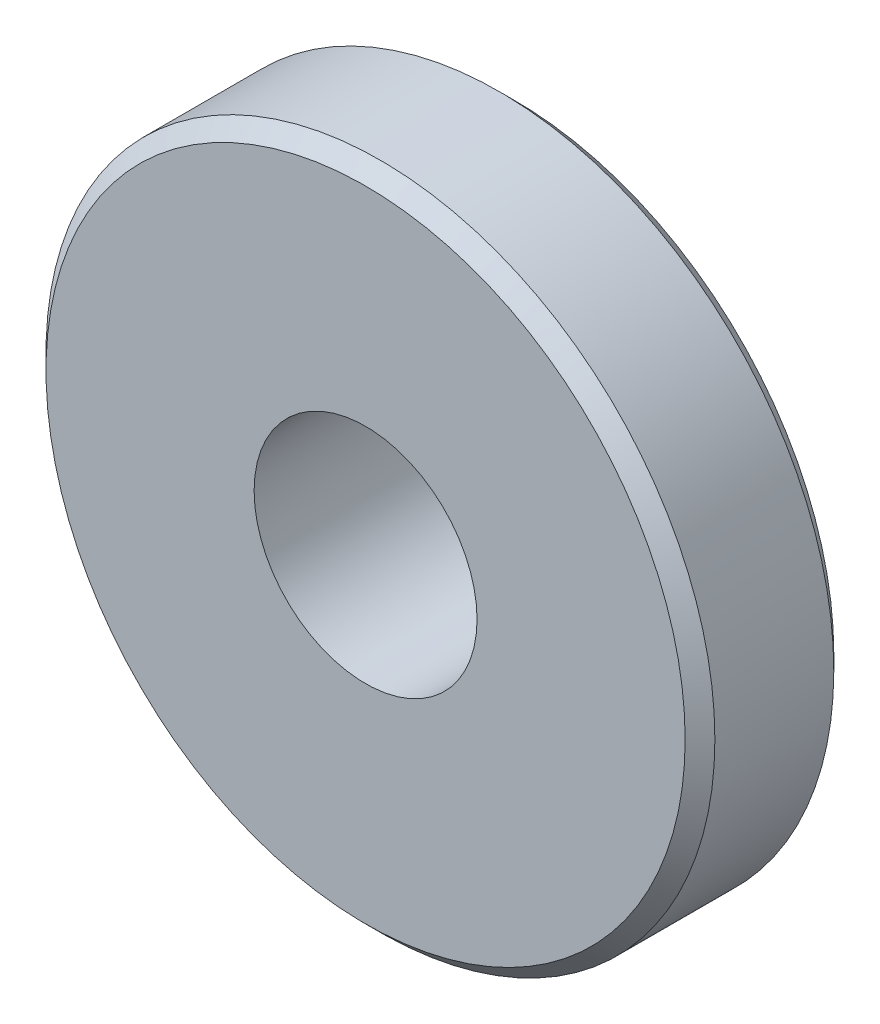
ISO-10303-21;
HEADER;
FILE_DESCRIPTION(('STEP AP214'),'2;1');
FILE_NAME('part.step','',(''),(''),'','','');
FILE_SCHEMA(('AUTOMOTIVE_DESIGN { 1 0 10303 214 1 1 1 1 }'));
ENDSEC;
DATA;
#1=APPLICATION_CONTEXT('core data for automotive mechanical design processes');
#2=APPLICATION_PROTOCOL_DEFINITION('international standard','automotive_design',2000,#1);
#3=PRODUCT_CONTEXT('',#1,'mechanical');
#4=PRODUCT('Part','Part','',(#3));
#5=PRODUCT_RELATED_PRODUCT_CATEGORY('part','',(#4));
#6=PRODUCT_DEFINITION_FORMATION('','',#4);
#7=PRODUCT_DEFINITION_CONTEXT('part definition',#1,'design');
#8=PRODUCT_DEFINITION('design','',#6,#7);
#9=PRODUCT_DEFINITION_SHAPE('','',#8);
#10=(LENGTH_UNIT() NAMED_UNIT(*) SI_UNIT(.MILLI.,.METRE.));
#11=(NAMED_UNIT(*) PLANE_ANGLE_UNIT() SI_UNIT($,.RADIAN.));
#12=(NAMED_UNIT(*) SI_UNIT($,.STERADIAN.) SOLID_ANGLE_UNIT());
#13=UNCERTAINTY_MEASURE_WITH_UNIT(LENGTH_MEASURE(1.E-05),#10,'distance_accuracy_value','');
#14=(GEOMETRIC_REPRESENTATION_CONTEXT(3) GLOBAL_UNCERTAINTY_ASSIGNED_CONTEXT((#13)) GLOBAL_UNIT_ASSIGNED_CONTEXT((#10,
#11,#12)) REPRESENTATION_CONTEXT('',''));
#15=CARTESIAN_POINT('',(0.,0.,0.));
#16=DIRECTION('',(0.,0.,1.));
#17=DIRECTION('',(1.,0.,0.));
#18=AXIS2_PLACEMENT_3D('',#15,#16,#17);
#19=CARTESIAN_POINT('',(0.,0.,2.));
#20=DIRECTION('',(0.,0.,-1.));
#21=DIRECTION('',(-1.,0.,0.));
#22=AXIS2_PLACEMENT_3D('',#19,#20,#21);
#23=CYLINDRICAL_SURFACE('',#22,10.);
#24=CARTESIAN_POINT('',(0.,0.,1.51));
#25=DIRECTION('',(0.,0.,1.));
#26=DIRECTION('',(1.,0.,0.));
#27=AXIS2_PLACEMENT_3D('',#24,#25,#26);
#28=CIRCLE('',#27,10.);
#29=CARTESIAN_POINT('',(10.,0.,1.51));
#30=VERTEX_POINT('',#29);
#31=EDGE_CURVE('E8',#30,#30,#28,.F.);
#32=ORIENTED_EDGE('',*,*,#31,.T.);
#33=EDGE_LOOP('',(#32));
#34=FACE_BOUND('',#33,.T.);
#35=CARTESIAN_POINT('',(0.,0.,0.));
#36=DIRECTION('',(0.,0.,1.));
#37=DIRECTION('',(1.,0.,0.));
#38=AXIS2_PLACEMENT_3D('',#35,#36,#37);
#39=CIRCLE('',#38,10.);
#40=CARTESIAN_POINT('',(10.,0.,0.));
#41=VERTEX_POINT('',#40);
#42=EDGE_CURVE('E38',#41,#41,#39,.T.);
#43=ORIENTED_EDGE('',*,*,#42,.T.);
#44=EDGE_LOOP('',(#43));
#45=FACE_BOUND('',#44,.T.);
#46=ADVANCED_FACE('F12',(#34,#45),#23,.T.);
#47=CARTESIAN_POINT('',(0.,0.,0.));
#48=DIRECTION('',(0.,0.,1.));
#49=DIRECTION('',(1.,0.,0.));
#50=AXIS2_PLACEMENT_3D('',#47,#48,#49);
#51=PLANE('',#50);
#52=CARTESIAN_POINT('',(0.,0.,0.));
#53=DIRECTION('',(0.,0.,-1.));
#54=DIRECTION('',(-1.,0.,0.));
#55=AXIS2_PLACEMENT_3D('',#52,#53,#54);
#56=CIRCLE('',#55,6.);
#57=CARTESIAN_POINT('',(-6.,0.,0.));
#58=VERTEX_POINT('',#57);
#59=EDGE_CURVE('E42',#58,#58,#56,.T.);
#60=ORIENTED_EDGE('',*,*,#59,.F.);
#61=EDGE_LOOP('',(#60));
#62=FACE_BOUND('',#61,.T.);
#63=ORIENTED_EDGE('',*,*,#42,.F.);
#64=EDGE_LOOP('',(#63));
#65=FACE_BOUND('',#64,.T.);
#66=ADVANCED_FACE('F57',(#62,#65),#51,.F.);
#67=CARTESIAN_POINT('',(0.,0.,2.));
#68=DIRECTION('',(0.,0.,1.));
#69=DIRECTION('',(1.,0.,0.));
#70=AXIS2_PLACEMENT_3D('',#67,#68,#69);
#71=PLANE('',#70);
#72=CARTESIAN_POINT('',(0.,0.,2.));
#73=DIRECTION('',(0.,0.,1.));
#74=DIRECTION('',(1.,0.,0.));
#75=AXIS2_PLACEMENT_3D('',#72,#73,#74);
#76=CIRCLE('',#75,10.49);
#77=CARTESIAN_POINT('',(10.49,0.,2.));
#78=VERTEX_POINT('',#77);
#79=EDGE_CURVE('E19',#78,#78,#76,.T.);
#80=ORIENTED_EDGE('',*,*,#79,.T.);
#81=EDGE_LOOP('',(#80));
#82=FACE_BOUND('',#81,.T.);
#83=CARTESIAN_POINT('',(0.,0.,2.));
#84=DIRECTION('',(0.,0.,1.));
#85=DIRECTION('',(1.,0.,0.));
#86=AXIS2_PLACEMENT_3D('',#83,#84,#85);
#87=CIRCLE('',#86,17.2);
#88=CARTESIAN_POINT('',(17.2,0.,2.));
#89=VERTEX_POINT('',#88);
#90=EDGE_CURVE('E27',#89,#89,#87,.F.);
#91=ORIENTED_EDGE('',*,*,#90,.T.);
#92=EDGE_LOOP('',(#91));
#93=FACE_BOUND('',#92,.T.);
#94=ADVANCED_FACE('F60',(#82,#93),#71,.F.);
#95=CARTESIAN_POINT('',(0.,0.,10.));
#96=DIRECTION('',(0.,0.,-1.));
#97=DIRECTION('',(-1.,0.,0.));
#98=AXIS2_PLACEMENT_3D('',#95,#96,#97);
#99=CYLINDRICAL_SURFACE('',#98,18.);
#100=CARTESIAN_POINT('',(0.,0.,2.8));
#101=DIRECTION('',(0.,0.,1.));
#102=DIRECTION('',(1.,0.,0.));
#103=AXIS2_PLACEMENT_3D('',#100,#101,#102);
#104=CIRCLE('',#103,18.);
#105=CARTESIAN_POINT('',(18.,0.,2.8));
#106=VERTEX_POINT('',#105);
#107=EDGE_CURVE('E32',#106,#106,#104,.T.);
#108=ORIENTED_EDGE('',*,*,#107,.T.);
#109=EDGE_LOOP('',(#108));
#110=FACE_BOUND('',#109,.T.);
#111=CARTESIAN_POINT('',(0.,0.,9.2));
#112=DIRECTION('',(0.,0.,1.));
#113=DIRECTION('',(1.,0.,0.));
#114=AXIS2_PLACEMENT_3D('',#111,#112,#113);
#115=CIRCLE('',#114,18.);
#116=CARTESIAN_POINT('',(18.,0.,9.2));
#117=VERTEX_POINT('',#116);
#118=EDGE_CURVE('E35',#117,#117,#115,.F.);
#119=ORIENTED_EDGE('',*,*,#118,.T.);
#120=EDGE_LOOP('',(#119));
#121=FACE_BOUND('',#120,.T.);
#122=ADVANCED_FACE('F87',(#110,#121),#99,.T.);
#123=CARTESIAN_POINT('',(0.,0.,10.));
#124=DIRECTION('',(0.,0.,1.));
#125=DIRECTION('',(1.,0.,0.));
#126=AXIS2_PLACEMENT_3D('',#123,#124,#125);
#127=PLANE('',#126);
#128=CARTESIAN_POINT('',(0.,0.,10.));
#129=DIRECTION('',(0.,0.,1.));
#130=DIRECTION('',(1.,0.,0.));
#131=AXIS2_PLACEMENT_3D('',#128,#129,#130);
#132=CIRCLE('',#131,17.2);
#133=CARTESIAN_POINT('',(17.2,0.,10.));
#134=VERTEX_POINT('',#133);
#135=EDGE_CURVE('E23',#134,#134,#132,.T.);
#136=ORIENTED_EDGE('',*,*,#135,.T.);
#137=EDGE_LOOP('',(#136));
#138=FACE_BOUND('',#137,.T.);
#139=CARTESIAN_POINT('',(0.,0.,10.));
#140=DIRECTION('',(0.,0.,-1.));
#141=DIRECTION('',(-1.,0.,0.));
#142=AXIS2_PLACEMENT_3D('',#139,#140,#141);
#143=CIRCLE('',#142,6.);
#144=CARTESIAN_POINT('',(-6.,0.,10.));
#145=VERTEX_POINT('',#144);
#146=EDGE_CURVE('E41',#145,#145,#143,.T.);
#147=ORIENTED_EDGE('',*,*,#146,.T.);
#148=EDGE_LOOP('',(#147));
#149=FACE_BOUND('',#148,.T.);
#150=ADVANCED_FACE('F48',(#138,#149),#127,.T.);
#151=CARTESIAN_POINT('',(0.,0.,10.));
#152=DIRECTION('',(0.,0.,-1.));
#153=DIRECTION('',(-1.,0.,0.));
#154=AXIS2_PLACEMENT_3D('',#151,#152,#153);
#155=CYLINDRICAL_SURFACE('',#154,6.);
#156=ORIENTED_EDGE('',*,*,#146,.F.);
#157=EDGE_LOOP('',(#156));
#158=FACE_BOUND('',#157,.T.);
#159=ORIENTED_EDGE('',*,*,#59,.T.);
#160=EDGE_LOOP('',(#159));
#161=FACE_BOUND('',#160,.T.);
#162=ADVANCED_FACE('F50',(#158,#161),#155,.F.);
#163=CARTESIAN_POINT('',(0.,0.,2.8));
#164=DIRECTION('',(0.,0.,1.));
#165=DIRECTION('',(1.,0.,0.));
#166=AXIS2_PLACEMENT_3D('',#163,#164,#165);
#167=CONICAL_SURFACE('',#166,18.,0.785398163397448);
#168=ORIENTED_EDGE('',*,*,#90,.F.);
#169=EDGE_LOOP('',(#168));
#170=FACE_BOUND('',#169,.T.);
#171=ORIENTED_EDGE('',*,*,#107,.F.);
#172=EDGE_LOOP('',(#171));
#173=FACE_BOUND('',#172,.T.);
#174=ADVANCED_FACE('F53',(#170,#173),#167,.T.);
#175=CARTESIAN_POINT('',(0.,0.,10.));
#176=DIRECTION('',(0.,0.,-1.));
#177=DIRECTION('',(-1.,0.,0.));
#178=AXIS2_PLACEMENT_3D('',#175,#176,#177);
#179=CONICAL_SURFACE('',#178,17.2,0.785398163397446);
#180=ORIENTED_EDGE('',*,*,#118,.F.);
#181=EDGE_LOOP('',(#180));
#182=FACE_BOUND('',#181,.T.);
#183=ORIENTED_EDGE('',*,*,#135,.F.);
#184=EDGE_LOOP('',(#183));
#185=FACE_BOUND('',#184,.T.);
#186=ADVANCED_FACE('F73',(#182,#185),#179,.T.);
#187=CARTESIAN_POINT('',(0.,0.,1.51));
#188=DIRECTION('',(0.,0.,1.));
#189=DIRECTION('',(1.,0.,0.));
#190=AXIS2_PLACEMENT_3D('',#187,#188,#189);
#191=TOROIDAL_SURFACE('',#190,10.49,0.49);
#192=ORIENTED_EDGE('',*,*,#31,.F.);
#193=EDGE_LOOP('',(#192));
#194=FACE_BOUND('',#193,.T.);
#195=ORIENTED_EDGE('',*,*,#79,.F.);
#196=EDGE_LOOP('',(#195));
#197=FACE_BOUND('',#196,.T.);
#198=ADVANCED_FACE('F14',(#194,#197),#191,.F.);
#199=CLOSED_SHELL('',(#46,#66,#94,#122,#150,#162,#174,#186,#198));
#200=MANIFOLD_SOLID_BREP('B1',#199);
#201=ADVANCED_BREP_SHAPE_REPRESENTATION('',(#18,#200),#14);
#202=SHAPE_DEFINITION_REPRESENTATION(#9,#201);
ENDSEC;
END-ISO-10303-21;
